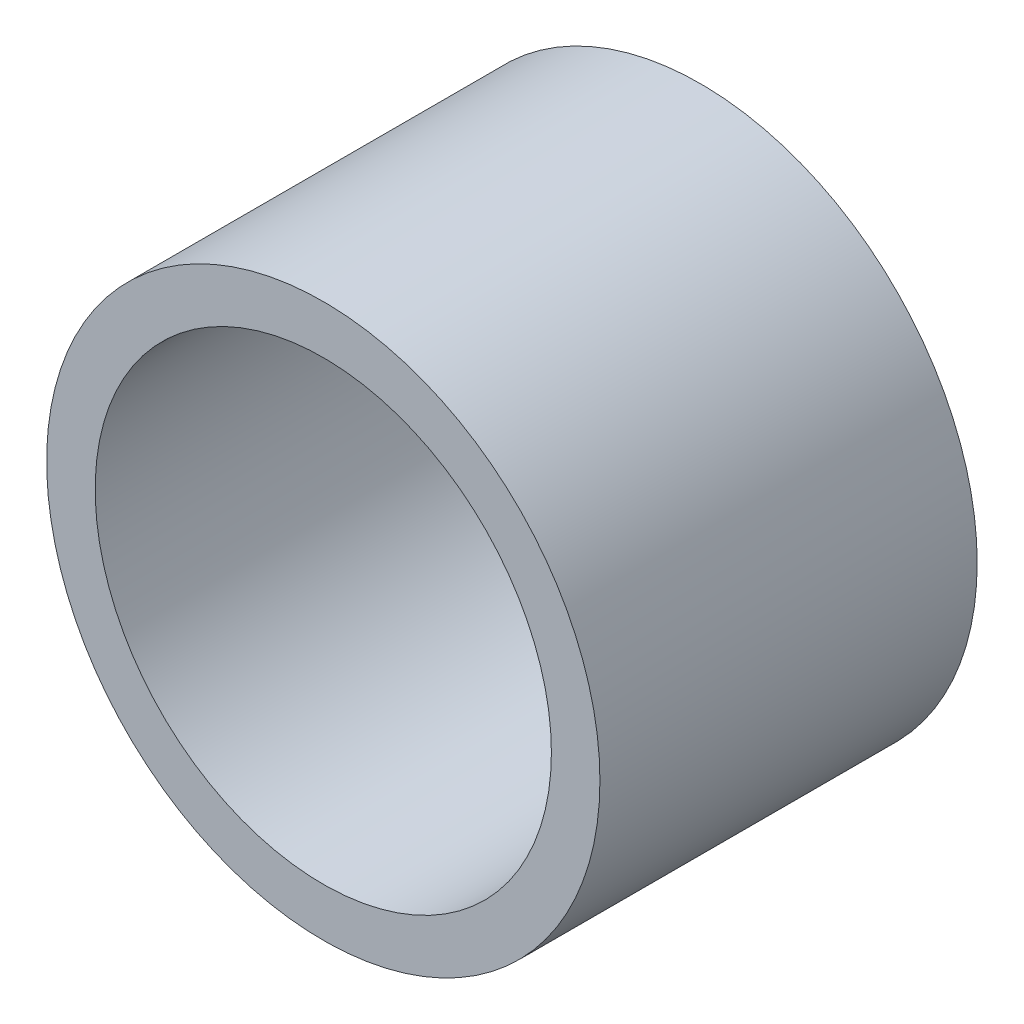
from build123d import *

# Parameters (mm, degrees)
SKETCH1_R           = 11
SKETCH1_R_2         = 9.07
BOSS_EXTRUDE1_DEPTH = 15


with BuildPart() as part:
    # Sketch1 → Boss-Extrude1 (new body)
    with BuildSketch(Plane.XY):
        Circle(SKETCH1_R)
        Circle(SKETCH1_R_2, mode=Mode.SUBTRACT)
    extrude(amount=BOSS_EXTRUDE1_DEPTH)


solid = part.part
